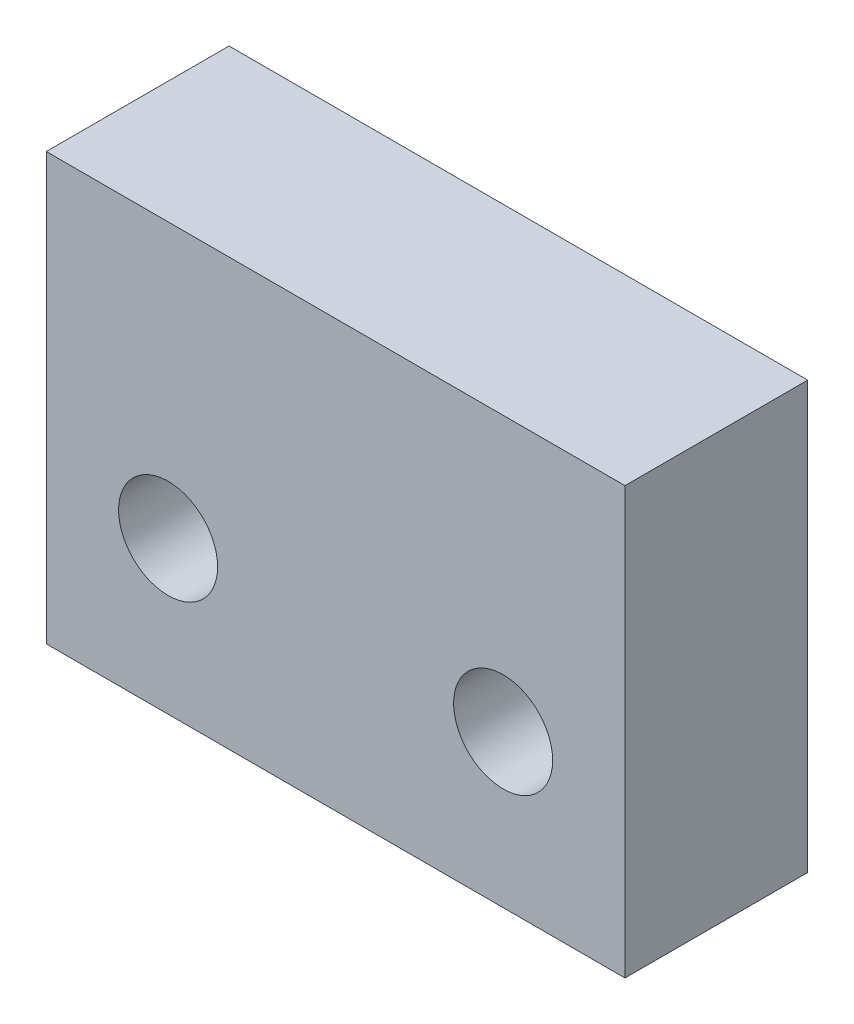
from build123d import *

# Parameters (mm, degrees)
SKETCH_1_W      = 38
SKETCH_1_H      = 28
SKETCH_1_R      = 3.25
EXTRUDE_1_DEPTH = 12


with BuildPart() as part:
    # Sketch 1 → Extrude 1 (new body)
    with BuildSketch(Plane.XY):
        with Locations((19, -14)):
            Rectangle(SKETCH_1_W, SKETCH_1_H)
        with Locations((8, -18)):
            Circle(SKETCH_1_R, mode=Mode.SUBTRACT)
        with Locations((30, -18)):
            Circle(SKETCH_1_R, mode=Mode.SUBTRACT)
    extrude(amount=EXTRUDE_1_DEPTH)


solid = part.part
